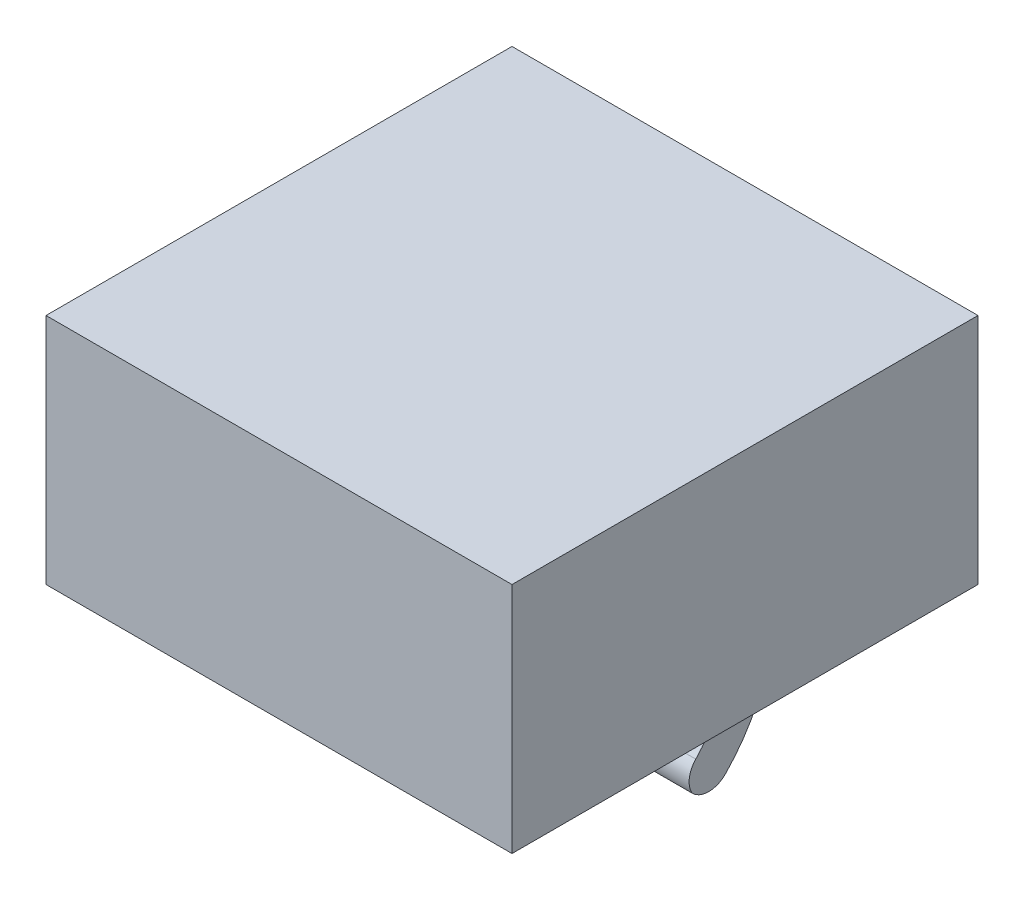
ISO-10303-21;
HEADER;
FILE_DESCRIPTION(('STEP AP214'),'2;1');
FILE_NAME('part.step','',(''),(''),'','','');
FILE_SCHEMA(('AUTOMOTIVE_DESIGN { 1 0 10303 214 1 1 1 1 }'));
ENDSEC;
DATA;
#1=APPLICATION_CONTEXT('core data for automotive mechanical design processes');
#2=APPLICATION_PROTOCOL_DEFINITION('international standard','automotive_design',2000,#1);
#3=PRODUCT_CONTEXT('',#1,'mechanical');
#4=PRODUCT('Part','Part','',(#3));
#5=PRODUCT_RELATED_PRODUCT_CATEGORY('part','',(#4));
#6=PRODUCT_DEFINITION_FORMATION('','',#4);
#7=PRODUCT_DEFINITION_CONTEXT('part definition',#1,'design');
#8=PRODUCT_DEFINITION('design','',#6,#7);
#9=PRODUCT_DEFINITION_SHAPE('','',#8);
#10=(LENGTH_UNIT() NAMED_UNIT(*) SI_UNIT(.MILLI.,.METRE.));
#11=(NAMED_UNIT(*) PLANE_ANGLE_UNIT() SI_UNIT($,.RADIAN.));
#12=(NAMED_UNIT(*) SI_UNIT($,.STERADIAN.) SOLID_ANGLE_UNIT());
#13=UNCERTAINTY_MEASURE_WITH_UNIT(LENGTH_MEASURE(1.E-05),#10,'distance_accuracy_value','');
#14=(GEOMETRIC_REPRESENTATION_CONTEXT(3) GLOBAL_UNCERTAINTY_ASSIGNED_CONTEXT((#13)) GLOBAL_UNIT_ASSIGNED_CONTEXT((#10,
#11,#12)) REPRESENTATION_CONTEXT('',''));
#15=CARTESIAN_POINT('',(0.,0.,0.));
#16=DIRECTION('',(0.,0.,1.));
#17=DIRECTION('',(1.,0.,0.));
#18=AXIS2_PLACEMENT_3D('',#15,#16,#17);
#19=CARTESIAN_POINT('',(12.7,0.,-40.8595379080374));
#20=DIRECTION('',(0.,1.,0.));
#21=DIRECTION('',(0.,0.,1.));
#22=AXIS2_PLACEMENT_3D('',#19,#20,#21);
#23=PLANE('',#22);
#24=DIRECTION('',(0.,0.,1.));
#25=VECTOR('',#24,1.);
#26=CARTESIAN_POINT('',(38.1,0.,-40.8595379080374));
#27=LINE('',#26,#25);
#28=CARTESIAN_POINT('',(38.1,0.,-40.8595379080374));
#29=VERTEX_POINT('',#28);
#30=CARTESIAN_POINT('',(38.1,0.,-35.3773366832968));
#31=VERTEX_POINT('',#30);
#32=EDGE_CURVE('E134',#29,#31,#27,.T.);
#33=ORIENTED_EDGE('',*,*,#32,.F.);
#34=DIRECTION('',(1.,0.,0.));
#35=VECTOR('',#34,1.);
#36=CARTESIAN_POINT('',(12.7,0.,-40.8595379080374));
#37=LINE('',#36,#35);
#38=CARTESIAN_POINT('',(12.7,0.,-40.8595379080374));
#39=VERTEX_POINT('',#38);
#40=EDGE_CURVE('E123',#39,#29,#37,.T.);
#41=ORIENTED_EDGE('',*,*,#40,.F.);
#42=DIRECTION('',(0.,0.,1.));
#43=VECTOR('',#42,1.);
#44=CARTESIAN_POINT('',(12.7,0.,-40.8595379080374));
#45=LINE('',#44,#43);
#46=CARTESIAN_POINT('',(12.7,0.,-35.3773366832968));
#47=VERTEX_POINT('',#46);
#48=EDGE_CURVE('E119',#39,#47,#45,.T.);
#49=ORIENTED_EDGE('',*,*,#48,.T.);
#50=DIRECTION('',(1.,0.,0.));
#51=VECTOR('',#50,1.);
#52=CARTESIAN_POINT('',(12.7,0.,-35.3773366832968));
#53=LINE('',#52,#51);
#54=EDGE_CURVE('E103',#47,#31,#53,.T.);
#55=ORIENTED_EDGE('',*,*,#54,.T.);
#56=EDGE_LOOP('',(#33,#41,#49,#55));
#57=FACE_BOUND('',#56,.T.);
#58=ADVANCED_FACE('F46',(#57),#23,.T.);
#59=CARTESIAN_POINT('',(12.7,-7.3248306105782,-40.8595379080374));
#60=DIRECTION('',(0.,0.,-1.));
#61=DIRECTION('',(-1.,0.,0.));
#62=AXIS2_PLACEMENT_3D('',#59,#60,#61);
#63=PLANE('',#62);
#64=DIRECTION('',(0.,1.,0.));
#65=VECTOR('',#64,1.);
#66=CARTESIAN_POINT('',(38.1,-7.3248306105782,-40.8595379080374));
#67=LINE('',#66,#65);
#68=CARTESIAN_POINT('',(38.1,-7.32483061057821,-40.8595379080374));
#69=VERTEX_POINT('',#68);
#70=EDGE_CURVE('E124',#69,#29,#67,.T.);
#71=ORIENTED_EDGE('',*,*,#70,.F.);
#72=DIRECTION('',(1.,0.,0.));
#73=VECTOR('',#72,1.);
#74=CARTESIAN_POINT('',(12.7,-7.32483061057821,-40.8595379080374));
#75=LINE('',#74,#73);
#76=CARTESIAN_POINT('',(12.7,-7.32483061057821,-40.8595379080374));
#77=VERTEX_POINT('',#76);
#78=EDGE_CURVE('E143',#77,#69,#75,.T.);
#79=ORIENTED_EDGE('',*,*,#78,.F.);
#80=DIRECTION('',(0.,1.,0.));
#81=VECTOR('',#80,1.);
#82=CARTESIAN_POINT('',(12.7,-7.3248306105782,-40.8595379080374));
#83=LINE('',#82,#81);
#84=EDGE_CURVE('E114',#77,#39,#83,.T.);
#85=ORIENTED_EDGE('',*,*,#84,.T.);
#86=ORIENTED_EDGE('',*,*,#40,.T.);
#87=EDGE_LOOP('',(#71,#79,#85,#86));
#88=FACE_BOUND('',#87,.T.);
#89=ADVANCED_FACE('F163',(#88),#63,.T.);
#90=CARTESIAN_POINT('',(12.7,-4.11466825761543,-22.9816122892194));
#91=DIRECTION('',(1.,0.,0.));
#92=DIRECTION('',(0.,0.,-1.));
#93=AXIS2_PLACEMENT_3D('',#90,#91,#92);
#94=CYLINDRICAL_SURFACE('',#93,18.1638477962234);
#95=CARTESIAN_POINT('',(38.1,-4.11466825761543,-22.9816122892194));
#96=DIRECTION('',(1.,0.,0.));
#97=DIRECTION('',(0.,0.,-1.));
#98=AXIS2_PLACEMENT_3D('',#95,#96,#97);
#99=CIRCLE('',#98,18.1638477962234);
#100=CARTESIAN_POINT('',(38.1,-16.8151497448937,-35.9671094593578));
#101=VERTEX_POINT('',#100);
#102=EDGE_CURVE('E127',#101,#69,#99,.T.);
#103=ORIENTED_EDGE('',*,*,#102,.F.);
#104=DIRECTION('',(1.,0.,0.));
#105=VECTOR('',#104,1.);
#106=CARTESIAN_POINT('',(12.7,-16.8151497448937,-35.9671094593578));
#107=LINE('',#106,#105);
#108=CARTESIAN_POINT('',(12.7,-16.8151497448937,-35.9671094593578));
#109=VERTEX_POINT('',#108);
#110=EDGE_CURVE('E150',#101,#109,#107,.F.);
#111=ORIENTED_EDGE('',*,*,#110,.T.);
#112=CARTESIAN_POINT('',(12.7,-4.11466825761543,-22.9816122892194));
#113=DIRECTION('',(1.,0.,0.));
#114=DIRECTION('',(0.,0.,-1.));
#115=AXIS2_PLACEMENT_3D('',#112,#113,#114);
#116=CIRCLE('',#115,18.1638477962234);
#117=EDGE_CURVE('E131',#109,#77,#116,.T.);
#118=ORIENTED_EDGE('',*,*,#117,.T.);
#119=ORIENTED_EDGE('',*,*,#78,.T.);
#120=EDGE_LOOP('',(#103,#111,#118,#119));
#121=FACE_BOUND('',#120,.T.);
#122=ADVANCED_FACE('F157',(#121),#94,.T.);
#123=CARTESIAN_POINT('',(12.7,-7.3248306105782,-26.1267297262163));
#124=DIRECTION('',(1.,0.,0.));
#125=DIRECTION('',(0.,0.,-1.));
#126=AXIS2_PLACEMENT_3D('',#123,#124,#125);
#127=CYLINDRICAL_SURFACE('',#126,9.25060695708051);
#128=CARTESIAN_POINT('',(12.7,-7.3248306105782,-26.1267297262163));
#129=DIRECTION('',(-1.,0.,0.));
#130=DIRECTION('',(0.,0.,1.));
#131=AXIS2_PLACEMENT_3D('',#128,#129,#130);
#132=CIRCLE('',#131,9.25060695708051);
#133=CARTESIAN_POINT('',(12.7,-7.3248306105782,-35.3773366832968));
#134=VERTEX_POINT('',#133);
#135=CARTESIAN_POINT('',(12.7,-13.8002286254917,-32.7330107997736));
#136=VERTEX_POINT('',#135);
#137=EDGE_CURVE('E121',#134,#136,#132,.T.);
#138=ORIENTED_EDGE('',*,*,#137,.T.);
#139=DIRECTION('',(1.,0.,0.));
#140=VECTOR('',#139,1.);
#141=CARTESIAN_POINT('',(12.7,-13.8002286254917,-32.7330107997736));
#142=LINE('',#141,#140);
#143=CARTESIAN_POINT('',(38.1,-13.8002286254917,-32.7330107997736));
#144=VERTEX_POINT('',#143);
#145=EDGE_CURVE('E12',#136,#144,#142,.T.);
#146=ORIENTED_EDGE('',*,*,#145,.T.);
#147=CARTESIAN_POINT('',(38.1,-7.3248306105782,-26.1267297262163));
#148=DIRECTION('',(-1.,0.,0.));
#149=DIRECTION('',(0.,0.,1.));
#150=AXIS2_PLACEMENT_3D('',#147,#148,#149);
#151=CIRCLE('',#150,9.25060695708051);
#152=CARTESIAN_POINT('',(38.1,-7.3248306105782,-35.3773366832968));
#153=VERTEX_POINT('',#152);
#154=EDGE_CURVE('E137',#153,#144,#151,.T.);
#155=ORIENTED_EDGE('',*,*,#154,.F.);
#156=DIRECTION('',(1.,0.,0.));
#157=VECTOR('',#156,1.);
#158=CARTESIAN_POINT('',(12.7,-7.3248306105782,-35.3773366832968));
#159=LINE('',#158,#157);
#160=EDGE_CURVE('E113',#134,#153,#159,.T.);
#161=ORIENTED_EDGE('',*,*,#160,.F.);
#162=EDGE_LOOP('',(#138,#146,#155,#161));
#163=FACE_BOUND('',#162,.T.);
#164=ADVANCED_FACE('F174',(#163),#127,.F.);
#165=CARTESIAN_POINT('',(12.7,0.,-35.3773366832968));
#166=DIRECTION('',(0.,0.,1.));
#167=DIRECTION('',(1.,0.,0.));
#168=AXIS2_PLACEMENT_3D('',#165,#166,#167);
#169=PLANE('',#168);
#170=DIRECTION('',(0.,-1.,0.));
#171=VECTOR('',#170,1.);
#172=CARTESIAN_POINT('',(38.1,0.,-35.3773366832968));
#173=LINE('',#172,#171);
#174=EDGE_CURVE('E108',#31,#153,#173,.T.);
#175=ORIENTED_EDGE('',*,*,#174,.F.);
#176=ORIENTED_EDGE('',*,*,#54,.F.);
#177=DIRECTION('',(0.,-1.,0.));
#178=VECTOR('',#177,1.);
#179=CARTESIAN_POINT('',(12.7,0.,-35.3773366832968));
#180=LINE('',#179,#178);
#181=EDGE_CURVE('E106',#47,#134,#180,.T.);
#182=ORIENTED_EDGE('',*,*,#181,.T.);
#183=ORIENTED_EDGE('',*,*,#160,.T.);
#184=EDGE_LOOP('',(#175,#176,#182,#183));
#185=FACE_BOUND('',#184,.T.);
#186=ADVANCED_FACE('F105',(#185),#169,.T.);
#187=CARTESIAN_POINT('',(12.7,-7.3248306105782,-26.1267297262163));
#188=DIRECTION('',(-1.,0.,0.));
#189=DIRECTION('',(0.,0.,1.));
#190=AXIS2_PLACEMENT_3D('',#187,#188,#189);
#191=PLANE('',#190);
#192=ORIENTED_EDGE('',*,*,#117,.F.);
#193=CARTESIAN_POINT('',(12.7,-15.0391371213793,-34.1512407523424));
#194=DIRECTION('',(-1.,0.,0.));
#195=DIRECTION('',(0.,0.,1.));
#196=AXIS2_PLACEMENT_3D('',#193,#194,#195);
#197=CIRCLE('',#196,2.54);
#198=CARTESIAN_POINT('',(12.7,-16.7985816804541,-32.3193142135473));
#199=VERTEX_POINT('',#198);
#200=EDGE_CURVE('E55',#109,#199,#197,.T.);
#201=ORIENTED_EDGE('',*,*,#200,.T.);
#202=CARTESIAN_POINT('',(12.7,-15.5782212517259,-34.5469408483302));
#203=DIRECTION('',(-1.,0.,0.));
#204=DIRECTION('',(0.,0.,1.));
#205=AXIS2_PLACEMENT_3D('',#202,#203,#204);
#206=CIRCLE('',#205,2.54);
#207=EDGE_CURVE('E65',#199,#136,#206,.T.);
#208=ORIENTED_EDGE('',*,*,#207,.T.);
#209=ORIENTED_EDGE('',*,*,#137,.F.);
#210=ORIENTED_EDGE('',*,*,#181,.F.);
#211=ORIENTED_EDGE('',*,*,#48,.F.);
#212=ORIENTED_EDGE('',*,*,#84,.F.);
#213=EDGE_LOOP('',(#192,#201,#208,#209,#210,#211,#212));
#214=FACE_BOUND('',#213,.T.);
#215=ADVANCED_FACE('F117',(#214),#191,.T.);
#216=CARTESIAN_POINT('',(38.1,-7.3248306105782,-26.1267297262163));
#217=DIRECTION('',(-1.,0.,0.));
#218=DIRECTION('',(0.,0.,1.));
#219=AXIS2_PLACEMENT_3D('',#216,#217,#218);
#220=PLANE('',#219);
#221=CARTESIAN_POINT('',(38.1,-15.5782212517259,-34.5469408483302));
#222=DIRECTION('',(-1.,0.,0.));
#223=DIRECTION('',(0.,0.,1.));
#224=AXIS2_PLACEMENT_3D('',#221,#222,#223);
#225=CIRCLE('',#224,2.54);
#226=CARTESIAN_POINT('',(38.1,-16.7985816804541,-32.3193142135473));
#227=VERTEX_POINT('',#226);
#228=EDGE_CURVE('E142',#144,#227,#225,.F.);
#229=ORIENTED_EDGE('',*,*,#228,.T.);
#230=CARTESIAN_POINT('',(38.1,-15.0391371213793,-34.1512407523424));
#231=DIRECTION('',(-1.,0.,0.));
#232=DIRECTION('',(0.,0.,1.));
#233=AXIS2_PLACEMENT_3D('',#230,#231,#232);
#234=CIRCLE('',#233,2.54);
#235=EDGE_CURVE('E148',#227,#101,#234,.F.);
#236=ORIENTED_EDGE('',*,*,#235,.T.);
#237=ORIENTED_EDGE('',*,*,#102,.T.);
#238=ORIENTED_EDGE('',*,*,#70,.T.);
#239=ORIENTED_EDGE('',*,*,#32,.T.);
#240=ORIENTED_EDGE('',*,*,#174,.T.);
#241=ORIENTED_EDGE('',*,*,#154,.T.);
#242=EDGE_LOOP('',(#229,#236,#237,#238,#239,#240,#241));
#243=FACE_BOUND('',#242,.T.);
#244=ADVANCED_FACE('F165',(#243),#220,.F.);
#245=CARTESIAN_POINT('',(12.7,-15.5782212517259,-34.5469408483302));
#246=DIRECTION('',(1.,0.,0.));
#247=DIRECTION('',(0.,0.,-1.));
#248=AXIS2_PLACEMENT_3D('',#245,#246,#247);
#249=CYLINDRICAL_SURFACE('',#248,2.54);
#250=ORIENTED_EDGE('',*,*,#145,.F.);
#251=ORIENTED_EDGE('',*,*,#207,.F.);
#252=DIRECTION('',(1.,0.,0.));
#253=VECTOR('',#252,1.);
#254=CARTESIAN_POINT('',(25.4,-16.7985816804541,-32.3193142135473));
#255=LINE('',#254,#253);
#256=EDGE_CURVE('E50',#227,#199,#255,.F.);
#257=ORIENTED_EDGE('',*,*,#256,.F.);
#258=ORIENTED_EDGE('',*,*,#228,.F.);
#259=EDGE_LOOP('',(#250,#251,#257,#258));
#260=FACE_BOUND('',#259,.T.);
#261=ADVANCED_FACE('F48',(#260),#249,.T.);
#262=CARTESIAN_POINT('',(12.7,-15.0391371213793,-34.1512407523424));
#263=DIRECTION('',(1.,0.,0.));
#264=DIRECTION('',(0.,0.,-1.));
#265=AXIS2_PLACEMENT_3D('',#262,#263,#264);
#266=CYLINDRICAL_SURFACE('',#265,2.54);
#267=ORIENTED_EDGE('',*,*,#200,.F.);
#268=ORIENTED_EDGE('',*,*,#110,.F.);
#269=ORIENTED_EDGE('',*,*,#235,.F.);
#270=ORIENTED_EDGE('',*,*,#256,.T.);
#271=EDGE_LOOP('',(#267,#268,#269,#270));
#272=FACE_BOUND('',#271,.T.);
#273=ADVANCED_FACE('F169',(#272),#266,.T.);
#274=CLOSED_SHELL('',(#58,#89,#122,#164,#186,#215,#244,#261,#273));
#275=MANIFOLD_SOLID_BREP('B2_NOT_SHOWN',#274);
#276=CARTESIAN_POINT('',(50.8,0.,0.));
#277=DIRECTION('',(0.,1.,0.));
#278=DIRECTION('',(0.,0.,1.));
#279=AXIS2_PLACEMENT_3D('',#276,#277,#278);
#280=PLANE('',#279);
#281=DIRECTION('',(1.,0.,0.));
#282=VECTOR('',#281,1.);
#283=CARTESIAN_POINT('',(12.7,0.,-40.8595379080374));
#284=LINE('',#283,#282);
#285=CARTESIAN_POINT('',(15.24,0.,-40.8595379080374));
#286=VERTEX_POINT('',#285);
#287=CARTESIAN_POINT('',(35.56,0.,-40.8595379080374));
#288=VERTEX_POINT('',#287);
#289=EDGE_CURVE('E545',#286,#288,#284,.T.);
#290=ORIENTED_EDGE('',*,*,#289,.F.);
#291=CARTESIAN_POINT('',(15.24,0.,-38.3195379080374));
#292=DIRECTION('',(0.,1.,0.));
#293=DIRECTION('',(0.,0.,1.));
#294=AXIS2_PLACEMENT_3D('',#291,#292,#293);
#295=CIRCLE('',#294,2.54);
#296=CARTESIAN_POINT('',(12.7,0.,-38.3195379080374));
#297=VERTEX_POINT('',#296);
#298=EDGE_CURVE('E265',#286,#297,#295,.T.);
#299=ORIENTED_EDGE('',*,*,#298,.T.);
#300=DIRECTION('',(0.,0.,-1.));
#301=VECTOR('',#300,1.);
#302=CARTESIAN_POINT('',(12.7,0.,-35.3773366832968));
#303=LINE('',#302,#301);
#304=CARTESIAN_POINT('',(12.7,0.,-35.3773366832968));
#305=VERTEX_POINT('',#304);
#306=EDGE_CURVE('E374',#305,#297,#303,.T.);
#307=ORIENTED_EDGE('',*,*,#306,.F.);
#308=DIRECTION('',(-1.,0.,0.));
#309=VECTOR('',#308,1.);
#310=CARTESIAN_POINT('',(12.7,0.,-35.3773366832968));
#311=LINE('',#310,#309);
#312=CARTESIAN_POINT('',(38.1,0.,-35.3773366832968));
#313=VERTEX_POINT('',#312);
#314=EDGE_CURVE('E382',#313,#305,#311,.T.);
#315=ORIENTED_EDGE('',*,*,#314,.F.);
#316=DIRECTION('',(0.,0.,1.));
#317=VECTOR('',#316,1.);
#318=CARTESIAN_POINT('',(38.1,0.,-35.3773366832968));
#319=LINE('',#318,#317);
#320=CARTESIAN_POINT('',(38.1,0.,-38.3195379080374));
#321=VERTEX_POINT('',#320);
#322=EDGE_CURVE('E390',#321,#313,#319,.T.);
#323=ORIENTED_EDGE('',*,*,#322,.F.);
#324=CARTESIAN_POINT('',(35.56,0.,-38.3195379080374));
#325=DIRECTION('',(0.,1.,0.));
#326=DIRECTION('',(0.,0.,1.));
#327=AXIS2_PLACEMENT_3D('',#324,#325,#326);
#328=CIRCLE('',#327,2.54);
#329=EDGE_CURVE('E44',#321,#288,#328,.T.);
#330=ORIENTED_EDGE('',*,*,#329,.T.);
#331=EDGE_LOOP('',(#290,#299,#307,#315,#323,#330));
#332=FACE_BOUND('',#331,.T.);
#333=DIRECTION('',(0.,0.,-1.));
#334=VECTOR('',#333,1.);
#335=CARTESIAN_POINT('',(0.,0.,0.));
#336=LINE('',#335,#334);
#337=CARTESIAN_POINT('',(0.,0.,0.));
#338=VERTEX_POINT('',#337);
#339=CARTESIAN_POINT('',(0.,0.,-50.8));
#340=VERTEX_POINT('',#339);
#341=EDGE_CURVE('E446',#338,#340,#336,.T.);
#342=ORIENTED_EDGE('',*,*,#341,.T.);
#343=DIRECTION('',(-1.,0.,0.));
#344=VECTOR('',#343,1.);
#345=CARTESIAN_POINT('',(50.8,0.,-50.8));
#346=LINE('',#345,#344);
#347=CARTESIAN_POINT('',(50.8,0.,-50.8));
#348=VERTEX_POINT('',#347);
#349=EDGE_CURVE('E456',#348,#340,#346,.T.);
#350=ORIENTED_EDGE('',*,*,#349,.F.);
#351=DIRECTION('',(0.,0.,-1.));
#352=VECTOR('',#351,1.);
#353=CARTESIAN_POINT('',(50.8,0.,0.));
#354=LINE('',#353,#352);
#355=CARTESIAN_POINT('',(50.8,0.,0.));
#356=VERTEX_POINT('',#355);
#357=EDGE_CURVE('E436',#356,#348,#354,.T.);
#358=ORIENTED_EDGE('',*,*,#357,.F.);
#359=DIRECTION('',(-1.,0.,0.));
#360=VECTOR('',#359,1.);
#361=CARTESIAN_POINT('',(50.8,0.,0.));
#362=LINE('',#361,#360);
#363=EDGE_CURVE('E459',#356,#338,#362,.T.);
#364=ORIENTED_EDGE('',*,*,#363,.T.);
#365=EDGE_LOOP('',(#342,#350,#358,#364));
#366=FACE_BOUND('',#365,.T.);
#367=DIRECTION('',(1.,0.,0.));
#368=VECTOR('',#367,1.);
#369=CARTESIAN_POINT('',(3.68715722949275,0.,-21.1582841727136));
#370=LINE('',#369,#368);
#371=CARTESIAN_POINT('',(3.68715722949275,0.,-21.1582841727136));
#372=VERTEX_POINT('',#371);
#373=CARTESIAN_POINT('',(46.3363601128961,0.,-21.1582841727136));
#374=VERTEX_POINT('',#373);
#375=EDGE_CURVE('E416',#372,#374,#370,.T.);
#376=ORIENTED_EDGE('',*,*,#375,.F.);
#377=DIRECTION('',(0.,0.,-1.));
#378=VECTOR('',#377,1.);
#379=CARTESIAN_POINT('',(3.68715722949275,0.,-4.27632009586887));
#380=LINE('',#379,#378);
#381=CARTESIAN_POINT('',(3.68715722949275,0.,-4.27632009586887));
#382=VERTEX_POINT('',#381);
#383=EDGE_CURVE('E400',#382,#372,#380,.T.);
#384=ORIENTED_EDGE('',*,*,#383,.F.);
#385=DIRECTION('',(-1.,0.,0.));
#386=VECTOR('',#385,1.);
#387=CARTESIAN_POINT('',(3.68715722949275,0.,-4.27632009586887));
#388=LINE('',#387,#386);
#389=CARTESIAN_POINT('',(46.3363601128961,0.,-4.27632009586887));
#390=VERTEX_POINT('',#389);
#391=EDGE_CURVE('E405',#390,#382,#388,.T.);
#392=ORIENTED_EDGE('',*,*,#391,.F.);
#393=DIRECTION('',(0.,0.,1.));
#394=VECTOR('',#393,1.);
#395=CARTESIAN_POINT('',(46.3363601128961,0.,-4.27632009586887));
#396=LINE('',#395,#394);
#397=EDGE_CURVE('E419',#374,#390,#396,.T.);
#398=ORIENTED_EDGE('',*,*,#397,.F.);
#399=EDGE_LOOP('',(#376,#384,#392,#398));
#400=FACE_BOUND('',#399,.T.);
#401=ADVANCED_FACE('F256',(#332,#366,#400),#280,.F.);
#402=CARTESIAN_POINT('',(50.8,0.,0.));
#403=DIRECTION('',(0.,0.,-1.));
#404=DIRECTION('',(0.,1.,0.));
#405=AXIS2_PLACEMENT_3D('',#402,#403,#404);
#406=PLANE('',#405);
#407=DIRECTION('',(0.,-1.,0.));
#408=VECTOR('',#407,1.);
#409=CARTESIAN_POINT('',(0.,0.,0.));
#410=LINE('',#409,#408);
#411=CARTESIAN_POINT('',(0.,25.4,0.));
#412=VERTEX_POINT('',#411);
#413=EDGE_CURVE('E426',#412,#338,#410,.T.);
#414=ORIENTED_EDGE('',*,*,#413,.T.);
#415=ORIENTED_EDGE('',*,*,#363,.F.);
#416=DIRECTION('',(0.,-1.,0.));
#417=VECTOR('',#416,1.);
#418=CARTESIAN_POINT('',(50.8,0.,0.));
#419=LINE('',#418,#417);
#420=CARTESIAN_POINT('',(50.8,25.4,0.));
#421=VERTEX_POINT('',#420);
#422=EDGE_CURVE('E433',#421,#356,#419,.T.);
#423=ORIENTED_EDGE('',*,*,#422,.F.);
#424=DIRECTION('',(-1.,0.,0.));
#425=VECTOR('',#424,1.);
#426=CARTESIAN_POINT('',(50.8,25.4,0.));
#427=LINE('',#426,#425);
#428=EDGE_CURVE('E443',#421,#412,#427,.T.);
#429=ORIENTED_EDGE('',*,*,#428,.T.);
#430=EDGE_LOOP('',(#414,#415,#423,#429));
#431=FACE_BOUND('',#430,.T.);
#432=ADVANCED_FACE('F520',(#431),#406,.F.);
#433=CARTESIAN_POINT('',(50.8,0.,-50.8));
#434=DIRECTION('',(0.,0.,1.));
#435=DIRECTION('',(1.,0.,0.));
#436=AXIS2_PLACEMENT_3D('',#433,#434,#435);
#437=PLANE('',#436);
#438=DIRECTION('',(0.,1.,0.));
#439=VECTOR('',#438,1.);
#440=CARTESIAN_POINT('',(0.,0.,-50.8));
#441=LINE('',#440,#439);
#442=CARTESIAN_POINT('',(0.,25.4,-50.8));
#443=VERTEX_POINT('',#442);
#444=EDGE_CURVE('E448',#340,#443,#441,.T.);
#445=ORIENTED_EDGE('',*,*,#444,.T.);
#446=DIRECTION('',(-1.,0.,0.));
#447=VECTOR('',#446,1.);
#448=CARTESIAN_POINT('',(50.8,25.4,-50.8));
#449=LINE('',#448,#447);
#450=CARTESIAN_POINT('',(50.8,25.4,-50.8));
#451=VERTEX_POINT('',#450);
#452=EDGE_CURVE('E453',#451,#443,#449,.T.);
#453=ORIENTED_EDGE('',*,*,#452,.F.);
#454=DIRECTION('',(0.,1.,0.));
#455=VECTOR('',#454,1.);
#456=CARTESIAN_POINT('',(50.8,0.,-50.8));
#457=LINE('',#456,#455);
#458=EDGE_CURVE('E439',#348,#451,#457,.T.);
#459=ORIENTED_EDGE('',*,*,#458,.F.);
#460=ORIENTED_EDGE('',*,*,#349,.T.);
#461=EDGE_LOOP('',(#445,#453,#459,#460));
#462=FACE_BOUND('',#461,.T.);
#463=ADVANCED_FACE('F525',(#462),#437,.F.);
#464=CARTESIAN_POINT('',(50.8,25.4,0.));
#465=DIRECTION('',(0.,-1.,0.));
#466=DIRECTION('',(0.,0.,-1.));
#467=AXIS2_PLACEMENT_3D('',#464,#465,#466);
#468=PLANE('',#467);
#469=DIRECTION('',(0.,0.,1.));
#470=VECTOR('',#469,1.);
#471=CARTESIAN_POINT('',(0.,25.4,0.));
#472=LINE('',#471,#470);
#473=EDGE_CURVE('E437',#443,#412,#472,.T.);
#474=ORIENTED_EDGE('',*,*,#473,.T.);
#475=ORIENTED_EDGE('',*,*,#428,.F.);
#476=DIRECTION('',(0.,0.,1.));
#477=VECTOR('',#476,1.);
#478=CARTESIAN_POINT('',(50.8,25.4,0.));
#479=LINE('',#478,#477);
#480=EDGE_CURVE('E441',#451,#421,#479,.T.);
#481=ORIENTED_EDGE('',*,*,#480,.F.);
#482=ORIENTED_EDGE('',*,*,#452,.T.);
#483=EDGE_LOOP('',(#474,#475,#481,#482));
#484=FACE_BOUND('',#483,.T.);
#485=ADVANCED_FACE('F588',(#484),#468,.F.);
#486=CARTESIAN_POINT('',(50.8,0.,0.));
#487=DIRECTION('',(-1.,0.,0.));
#488=DIRECTION('',(0.,0.,1.));
#489=AXIS2_PLACEMENT_3D('',#486,#487,#488);
#490=PLANE('',#489);
#491=ORIENTED_EDGE('',*,*,#422,.T.);
#492=ORIENTED_EDGE('',*,*,#357,.T.);
#493=ORIENTED_EDGE('',*,*,#458,.T.);
#494=ORIENTED_EDGE('',*,*,#480,.T.);
#495=EDGE_LOOP('',(#491,#492,#493,#494));
#496=FACE_BOUND('',#495,.T.);
#497=ADVANCED_FACE('F585',(#496),#490,.F.);
#498=CARTESIAN_POINT('',(0.,0.,0.));
#499=DIRECTION('',(-1.,0.,0.));
#500=DIRECTION('',(0.,0.,1.));
#501=AXIS2_PLACEMENT_3D('',#498,#499,#500);
#502=PLANE('',#501);
#503=ORIENTED_EDGE('',*,*,#413,.F.);
#504=ORIENTED_EDGE('',*,*,#473,.F.);
#505=ORIENTED_EDGE('',*,*,#444,.F.);
#506=ORIENTED_EDGE('',*,*,#341,.F.);
#507=EDGE_LOOP('',(#503,#504,#505,#506));
#508=FACE_BOUND('',#507,.T.);
#509=ADVANCED_FACE('F583',(#508),#502,.T.);
#510=CARTESIAN_POINT('',(3.68715722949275,11.176,-4.27632009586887));
#511=DIRECTION('',(-1.,0.,0.));
#512=DIRECTION('',(0.,0.,1.));
#513=AXIS2_PLACEMENT_3D('',#510,#511,#512);
#514=PLANE('',#513);
#515=ORIENTED_EDGE('',*,*,#383,.T.);
#516=DIRECTION('',(0.,-1.,0.));
#517=VECTOR('',#516,1.);
#518=CARTESIAN_POINT('',(3.68715722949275,11.176,-21.1582841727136));
#519=LINE('',#518,#517);
#520=CARTESIAN_POINT('',(3.68715722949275,11.176,-21.1582841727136));
#521=VERTEX_POINT('',#520);
#522=EDGE_CURVE('E414',#521,#372,#519,.T.);
#523=ORIENTED_EDGE('',*,*,#522,.F.);
#524=DIRECTION('',(0.,0.,-1.));
#525=VECTOR('',#524,1.);
#526=CARTESIAN_POINT('',(3.68715722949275,11.176,-4.27632009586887));
#527=LINE('',#526,#525);
#528=CARTESIAN_POINT('',(3.68715722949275,11.176,-4.27632009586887));
#529=VERTEX_POINT('',#528);
#530=EDGE_CURVE('E401',#529,#521,#527,.T.);
#531=ORIENTED_EDGE('',*,*,#530,.F.);
#532=DIRECTION('',(0.,-1.,0.));
#533=VECTOR('',#532,1.);
#534=CARTESIAN_POINT('',(3.68715722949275,11.176,-4.27632009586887));
#535=LINE('',#534,#533);
#536=EDGE_CURVE('E424',#529,#382,#535,.T.);
#537=ORIENTED_EDGE('',*,*,#536,.T.);
#538=EDGE_LOOP('',(#515,#523,#531,#537));
#539=FACE_BOUND('',#538,.T.);
#540=ADVANCED_FACE('F573',(#539),#514,.F.);
#541=CARTESIAN_POINT('',(3.68715722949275,11.176,-4.27632009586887));
#542=DIRECTION('',(0.,0.,1.));
#543=DIRECTION('',(1.,0.,0.));
#544=AXIS2_PLACEMENT_3D('',#541,#542,#543);
#545=PLANE('',#544);
#546=ORIENTED_EDGE('',*,*,#391,.T.);
#547=ORIENTED_EDGE('',*,*,#536,.F.);
#548=DIRECTION('',(-1.,0.,0.));
#549=VECTOR('',#548,1.);
#550=CARTESIAN_POINT('',(3.68715722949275,11.176,-4.27632009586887));
#551=LINE('',#550,#549);
#552=CARTESIAN_POINT('',(46.3363601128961,11.176,-4.27632009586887));
#553=VERTEX_POINT('',#552);
#554=EDGE_CURVE('E411',#553,#529,#551,.T.);
#555=ORIENTED_EDGE('',*,*,#554,.F.);
#556=DIRECTION('',(0.,-1.,0.));
#557=VECTOR('',#556,1.);
#558=CARTESIAN_POINT('',(46.3363601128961,11.176,-4.27632009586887));
#559=LINE('',#558,#557);
#560=EDGE_CURVE('E427',#553,#390,#559,.T.);
#561=ORIENTED_EDGE('',*,*,#560,.T.);
#562=EDGE_LOOP('',(#546,#547,#555,#561));
#563=FACE_BOUND('',#562,.T.);
#564=ADVANCED_FACE('F569',(#563),#545,.F.);
#565=CARTESIAN_POINT('',(46.3363601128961,11.176,-4.27632009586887));
#566=DIRECTION('',(1.,0.,0.));
#567=DIRECTION('',(0.,0.,-1.));
#568=AXIS2_PLACEMENT_3D('',#565,#566,#567);
#569=PLANE('',#568);
#570=ORIENTED_EDGE('',*,*,#397,.T.);
#571=ORIENTED_EDGE('',*,*,#560,.F.);
#572=DIRECTION('',(0.,0.,1.));
#573=VECTOR('',#572,1.);
#574=CARTESIAN_POINT('',(46.3363601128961,11.176,-4.27632009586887));
#575=LINE('',#574,#573);
#576=CARTESIAN_POINT('',(46.3363601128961,11.176,-21.1582841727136));
#577=VERTEX_POINT('',#576);
#578=EDGE_CURVE('E408',#577,#553,#575,.T.);
#579=ORIENTED_EDGE('',*,*,#578,.F.);
#580=DIRECTION('',(0.,-1.,0.));
#581=VECTOR('',#580,1.);
#582=CARTESIAN_POINT('',(46.3363601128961,11.176,-21.1582841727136));
#583=LINE('',#582,#581);
#584=EDGE_CURVE('E429',#577,#374,#583,.T.);
#585=ORIENTED_EDGE('',*,*,#584,.T.);
#586=EDGE_LOOP('',(#570,#571,#579,#585));
#587=FACE_BOUND('',#586,.T.);
#588=ADVANCED_FACE('F572',(#587),#569,.F.);
#589=CARTESIAN_POINT('',(3.68715722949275,11.176,-21.1582841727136));
#590=DIRECTION('',(0.,0.,-1.));
#591=DIRECTION('',(-1.,0.,0.));
#592=AXIS2_PLACEMENT_3D('',#589,#590,#591);
#593=PLANE('',#592);
#594=ORIENTED_EDGE('',*,*,#375,.T.);
#595=ORIENTED_EDGE('',*,*,#584,.F.);
#596=DIRECTION('',(1.,0.,0.));
#597=VECTOR('',#596,1.);
#598=CARTESIAN_POINT('',(3.68715722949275,11.176,-21.1582841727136));
#599=LINE('',#598,#597);
#600=EDGE_CURVE('E404',#521,#577,#599,.T.);
#601=ORIENTED_EDGE('',*,*,#600,.F.);
#602=ORIENTED_EDGE('',*,*,#522,.T.);
#603=EDGE_LOOP('',(#594,#595,#601,#602));
#604=FACE_BOUND('',#603,.T.);
#605=ADVANCED_FACE('F567',(#604),#593,.F.);
#606=CARTESIAN_POINT('',(0.,11.176,0.));
#607=DIRECTION('',(0.,-1.,0.));
#608=DIRECTION('',(0.,0.,-1.));
#609=AXIS2_PLACEMENT_3D('',#606,#607,#608);
#610=PLANE('',#609);
#611=ORIENTED_EDGE('',*,*,#530,.T.);
#612=ORIENTED_EDGE('',*,*,#600,.T.);
#613=ORIENTED_EDGE('',*,*,#578,.T.);
#614=ORIENTED_EDGE('',*,*,#554,.T.);
#615=EDGE_LOOP('',(#611,#612,#613,#614));
#616=FACE_BOUND('',#615,.T.);
#617=ADVANCED_FACE('F561',(#616),#610,.T.);
#618=CARTESIAN_POINT('',(12.7,-23.876,-35.3773366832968));
#619=DIRECTION('',(1.,0.,0.));
#620=DIRECTION('',(0.,0.,-1.));
#621=AXIS2_PLACEMENT_3D('',#618,#619,#620);
#622=PLANE('',#621);
#623=ORIENTED_EDGE('',*,*,#306,.T.);
#624=DIRECTION('',(0.,-1.,0.));
#625=VECTOR('',#624,1.);
#626=CARTESIAN_POINT('',(12.7,-23.876,-38.3195379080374));
#627=LINE('',#626,#625);
#628=CARTESIAN_POINT('',(12.7,-7.32483061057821,-38.3195379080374));
#629=VERTEX_POINT('',#628);
#630=EDGE_CURVE('E465',#297,#629,#627,.T.);
#631=ORIENTED_EDGE('',*,*,#630,.T.);
#632=CARTESIAN_POINT('',(12.7,-7.32483061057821,-28.8761962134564));
#633=DIRECTION('',(1.,0.,0.));
#634=DIRECTION('',(0.,0.,-1.));
#635=AXIS2_PLACEMENT_3D('',#632,#633,#634);
#636=CIRCLE('',#635,9.44334169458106);
#637=CARTESIAN_POINT('',(12.7,-12.3625515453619,-36.8635656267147));
#638=VERTEX_POINT('',#637);
#639=EDGE_CURVE('E463',#629,#638,#636,.F.);
#640=ORIENTED_EDGE('',*,*,#639,.T.);
#641=CARTESIAN_POINT('',(12.7,-10.0514551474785,-37.9173366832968));
#642=DIRECTION('',(1.,0.,0.));
#643=DIRECTION('',(0.,0.,-1.));
#644=AXIS2_PLACEMENT_3D('',#641,#642,#643);
#645=CIRCLE('',#644,2.54);
#646=CARTESIAN_POINT('',(12.7,-10.0514551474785,-35.3773366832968));
#647=VERTEX_POINT('',#646);
#648=EDGE_CURVE('E377',#638,#647,#645,.F.);
#649=ORIENTED_EDGE('',*,*,#648,.T.);
#650=DIRECTION('',(0.,1.,0.));
#651=VECTOR('',#650,1.);
#652=CARTESIAN_POINT('',(12.7,-23.876,-35.3773366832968));
#653=LINE('',#652,#651);
#654=EDGE_CURVE('E370',#647,#305,#653,.T.);
#655=ORIENTED_EDGE('',*,*,#654,.T.);
#656=EDGE_LOOP('',(#623,#631,#640,#649,#655));
#657=FACE_BOUND('',#656,.T.);
#658=ADVANCED_FACE('F372',(#657),#622,.F.);
#659=CARTESIAN_POINT('',(38.1,-23.876,-35.3773366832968));
#660=DIRECTION('',(-1.,0.,0.));
#661=DIRECTION('',(0.,0.,1.));
#662=AXIS2_PLACEMENT_3D('',#659,#660,#661);
#663=PLANE('',#662);
#664=CARTESIAN_POINT('',(38.1,-7.32483061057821,-28.8761962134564));
#665=DIRECTION('',(-1.,0.,0.));
#666=DIRECTION('',(0.,0.,1.));
#667=AXIS2_PLACEMENT_3D('',#664,#665,#666);
#668=CIRCLE('',#667,9.44334169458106);
#669=CARTESIAN_POINT('',(38.1,-12.3625515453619,-36.8635656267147));
#670=VERTEX_POINT('',#669);
#671=CARTESIAN_POINT('',(38.1,-7.32483061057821,-38.3195379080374));
#672=VERTEX_POINT('',#671);
#673=EDGE_CURVE('E471',#670,#672,#668,.F.);
#674=ORIENTED_EDGE('',*,*,#673,.T.);
#675=DIRECTION('',(0.,-1.,0.));
#676=VECTOR('',#675,1.);
#677=CARTESIAN_POINT('',(38.1,-23.876,-38.3195379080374));
#678=LINE('',#677,#676);
#679=EDGE_CURVE('E475',#672,#321,#678,.F.);
#680=ORIENTED_EDGE('',*,*,#679,.T.);
#681=ORIENTED_EDGE('',*,*,#322,.T.);
#682=DIRECTION('',(0.,1.,0.));
#683=VECTOR('',#682,1.);
#684=CARTESIAN_POINT('',(38.1,-23.876,-35.3773366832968));
#685=LINE('',#684,#683);
#686=CARTESIAN_POINT('',(38.1,-10.0514551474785,-35.3773366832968));
#687=VERTEX_POINT('',#686);
#688=EDGE_CURVE('E381',#687,#313,#685,.T.);
#689=ORIENTED_EDGE('',*,*,#688,.F.);
#690=CARTESIAN_POINT('',(38.1,-10.0514551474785,-37.9173366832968));
#691=DIRECTION('',(-1.,0.,0.));
#692=DIRECTION('',(0.,0.,1.));
#693=AXIS2_PLACEMENT_3D('',#690,#691,#692);
#694=CIRCLE('',#693,2.54);
#695=EDGE_CURVE('E473',#687,#670,#694,.F.);
#696=ORIENTED_EDGE('',*,*,#695,.T.);
#697=EDGE_LOOP('',(#674,#680,#681,#689,#696));
#698=FACE_BOUND('',#697,.T.);
#699=ADVANCED_FACE('F552',(#698),#663,.F.);
#700=CARTESIAN_POINT('',(12.7,-23.876,-35.3773366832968));
#701=DIRECTION('',(0.,0.,-1.));
#702=DIRECTION('',(-1.,0.,0.));
#703=AXIS2_PLACEMENT_3D('',#700,#701,#702);
#704=PLANE('',#703);
#705=ORIENTED_EDGE('',*,*,#654,.F.);
#706=DIRECTION('',(1.,0.,0.));
#707=VECTOR('',#706,1.);
#708=CARTESIAN_POINT('',(12.7,-10.0514551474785,-35.3773366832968));
#709=LINE('',#708,#707);
#710=EDGE_CURVE('E481',#647,#687,#709,.T.);
#711=ORIENTED_EDGE('',*,*,#710,.T.);
#712=ORIENTED_EDGE('',*,*,#688,.T.);
#713=ORIENTED_EDGE('',*,*,#314,.T.);
#714=EDGE_LOOP('',(#705,#711,#712,#713));
#715=FACE_BOUND('',#714,.T.);
#716=ADVANCED_FACE('F394',(#715),#704,.F.);
#717=CARTESIAN_POINT('',(12.7,-7.32483061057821,-28.8761962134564));
#718=DIRECTION('',(1.,0.,0.));
#719=DIRECTION('',(0.,0.,-1.));
#720=AXIS2_PLACEMENT_3D('',#717,#718,#719);
#721=CYLINDRICAL_SURFACE('',#720,11.9833416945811);
#722=DIRECTION('',(1.,0.,0.));
#723=VECTOR('',#722,1.);
#724=CARTESIAN_POINT('',(12.7,-10.7848423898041,-40.3491555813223));
#725=LINE('',#724,#723);
#726=CARTESIAN_POINT('',(35.56,-10.7848423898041,-40.3491555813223));
#727=VERTEX_POINT('',#726);
#728=CARTESIAN_POINT('',(15.24,-10.7848423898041,-40.3491555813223));
#729=VERTEX_POINT('',#728);
#730=EDGE_CURVE('E273',#727,#729,#725,.F.);
#731=ORIENTED_EDGE('',*,*,#730,.T.);
#732=CARTESIAN_POINT('',(15.24,-7.32483061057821,-28.8761962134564));
#733=DIRECTION('',(1.,0.,0.));
#734=DIRECTION('',(0.,0.,-1.));
#735=AXIS2_PLACEMENT_3D('',#732,#733,#734);
#736=CIRCLE('',#735,11.9833416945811);
#737=CARTESIAN_POINT('',(15.24,-7.32483061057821,-40.8595379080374));
#738=VERTEX_POINT('',#737);
#739=EDGE_CURVE('E479',#729,#738,#736,.T.);
#740=ORIENTED_EDGE('',*,*,#739,.T.);
#741=DIRECTION('',(1.,0.,0.));
#742=VECTOR('',#741,1.);
#743=CARTESIAN_POINT('',(12.7,-7.32483061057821,-40.8595379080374));
#744=LINE('',#743,#742);
#745=CARTESIAN_POINT('',(35.56,-7.32483061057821,-40.8595379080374));
#746=VERTEX_POINT('',#745);
#747=EDGE_CURVE('E391',#738,#746,#744,.T.);
#748=ORIENTED_EDGE('',*,*,#747,.T.);
#749=CARTESIAN_POINT('',(35.56,-7.32483061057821,-28.8761962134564));
#750=DIRECTION('',(-1.,0.,0.));
#751=DIRECTION('',(0.,0.,1.));
#752=AXIS2_PLACEMENT_3D('',#749,#750,#751);
#753=CIRCLE('',#752,11.9833416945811);
#754=EDGE_CURVE('E278',#746,#727,#753,.T.);
#755=ORIENTED_EDGE('',*,*,#754,.T.);
#756=EDGE_LOOP('',(#731,#740,#748,#755));
#757=FACE_BOUND('',#756,.T.);
#758=ADVANCED_FACE('F540',(#757),#721,.T.);
#759=CARTESIAN_POINT('',(12.7,0.,-40.8595379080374));
#760=DIRECTION('',(0.,0.,1.));
#761=DIRECTION('',(1.,0.,0.));
#762=AXIS2_PLACEMENT_3D('',#759,#760,#761);
#763=PLANE('',#762);
#764=ORIENTED_EDGE('',*,*,#747,.F.);
#765=DIRECTION('',(0.,-1.,0.));
#766=VECTOR('',#765,1.);
#767=CARTESIAN_POINT('',(15.24,0.,-40.8595379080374));
#768=LINE('',#767,#766);
#769=EDGE_CURVE('E469',#738,#286,#768,.F.);
#770=ORIENTED_EDGE('',*,*,#769,.T.);
#771=ORIENTED_EDGE('',*,*,#289,.T.);
#772=DIRECTION('',(0.,-1.,0.));
#773=VECTOR('',#772,1.);
#774=CARTESIAN_POINT('',(35.56,0.,-40.8595379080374));
#775=LINE('',#774,#773);
#776=EDGE_CURVE('E467',#288,#746,#775,.T.);
#777=ORIENTED_EDGE('',*,*,#776,.T.);
#778=EDGE_LOOP('',(#764,#770,#771,#777));
#779=FACE_BOUND('',#778,.T.);
#780=ADVANCED_FACE('F516',(#779),#763,.F.);
#781=CARTESIAN_POINT('',(35.56,0.,-38.3195379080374));
#782=DIRECTION('',(0.,-1.,0.));
#783=DIRECTION('',(0.,0.,-1.));
#784=AXIS2_PLACEMENT_3D('',#781,#782,#783);
#785=CYLINDRICAL_SURFACE('',#784,2.54);
#786=ORIENTED_EDGE('',*,*,#329,.F.);
#787=ORIENTED_EDGE('',*,*,#679,.F.);
#788=CARTESIAN_POINT('',(35.56,-7.32483061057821,-38.3195379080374));
#789=DIRECTION('',(0.,-1.,0.));
#790=DIRECTION('',(0.,0.,-1.));
#791=AXIS2_PLACEMENT_3D('',#788,#789,#790);
#792=CIRCLE('',#791,2.54);
#793=EDGE_CURVE('E260',#746,#672,#792,.T.);
#794=ORIENTED_EDGE('',*,*,#793,.F.);
#795=ORIENTED_EDGE('',*,*,#776,.F.);
#796=EDGE_LOOP('',(#786,#787,#794,#795));
#797=FACE_BOUND('',#796,.T.);
#798=ADVANCED_FACE('F258',(#797),#785,.T.);
#799=CARTESIAN_POINT('',(35.56,-7.32483061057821,-28.8761962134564));
#800=DIRECTION('',(-1.,0.,0.));
#801=DIRECTION('',(0.,0.,1.));
#802=AXIS2_PLACEMENT_3D('',#799,#800,#801);
#803=TOROIDAL_SURFACE('',#802,9.44334169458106,2.54);
#804=ORIENTED_EDGE('',*,*,#793,.T.);
#805=ORIENTED_EDGE('',*,*,#673,.F.);
#806=CARTESIAN_POINT('',(38.1,-12.3625515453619,-36.8635656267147));
#807=CARTESIAN_POINT('',(38.1000118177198,-12.3869216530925,-36.9169785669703));
#808=CARTESIAN_POINT('',(38.0980015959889,-12.4094062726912,-36.9712310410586));
#809=CARTESIAN_POINT('',(38.0901432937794,-12.4504789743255,-37.0808629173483));
#810=CARTESIAN_POINT('',(38.0842989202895,-12.4690707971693,-37.1362411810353));
#811=CARTESIAN_POINT('',(38.0690416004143,-12.5021414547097,-37.2472133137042));
#812=CARTESIAN_POINT('',(38.0596587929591,-12.5166532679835,-37.3028015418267));
#813=CARTESIAN_POINT('',(38.0375838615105,-12.541778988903,-37.4141947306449));
#814=CARTESIAN_POINT('',(38.0248910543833,-12.5523920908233,-37.4699997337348));
#815=CARTESIAN_POINT('',(37.9823648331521,-12.5783948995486,-37.6366953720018));
#816=CARTESIAN_POINT('',(37.9480088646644,-12.5880984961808,-37.7473817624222));
#817=CARTESIAN_POINT('',(37.8694230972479,-12.5933549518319,-37.9656375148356));
#818=CARTESIAN_POINT('',(37.8251698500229,-12.5888738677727,-38.0731987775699));
#819=CARTESIAN_POINT('',(37.7101953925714,-12.5629615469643,-38.323970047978));
#820=CARTESIAN_POINT('',(37.6358496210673,-12.5356578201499,-38.464923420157));
#821=CARTESIAN_POINT('',(37.4763240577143,-12.4604701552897,-38.7346019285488));
#822=CARTESIAN_POINT('',(37.3911287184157,-12.4125564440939,-38.8633090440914));
#823=CARTESIAN_POINT('',(37.1874314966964,-12.2834131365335,-39.1420043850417));
#824=CARTESIAN_POINT('',(37.0663801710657,-12.1965714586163,-39.2875255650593));
#825=CARTESIAN_POINT('',(36.8159860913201,-12.0006160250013,-39.5543548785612));
#826=CARTESIAN_POINT('',(36.686634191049,-11.8914774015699,-39.6756356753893));
#827=CARTESIAN_POINT('',(36.4207246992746,-11.6539593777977,-39.8947327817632));
#828=CARTESIAN_POINT('',(36.2840849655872,-11.525300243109,-39.9921429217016));
#829=CARTESIAN_POINT('',(36.00820312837,-11.2545105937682,-40.1600069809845));
#830=CARTESIAN_POINT('',(35.8689664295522,-11.1124059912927,-40.2305114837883));
#831=CARTESIAN_POINT('',(35.6755113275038,-10.9086683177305,-40.3090922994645));
#832=CARTESIAN_POINT('',(35.6215255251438,-10.8511353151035,-40.3289358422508));
#833=CARTESIAN_POINT('',(35.5650253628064,-10.7902609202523,-40.347516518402));
#834=CARTESIAN_POINT('',(35.5625126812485,-10.7875523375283,-40.348338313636));
#835=CARTESIAN_POINT('',(35.56,-10.784842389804,-40.3491555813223));
#836=B_SPLINE_CURVE_WITH_KNOTS('',3,(#806,#807,#808,#809,#810,#811,#812,#813,#814,#815,#816,
#817,#818,#819,#820,#821,#822,#823,#824,#825,#826,#827,#828,#829,#830,#831,#832,#833,#834,#835),
.UNSPECIFIED.,.F.,.F.,(4,2,2,2,2,2,2,2,2,2,2,2,2,2,4),(0.,0.176030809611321,0.351891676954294,
0.526287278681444,0.700718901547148,1.0479779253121,1.39606854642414,1.87845492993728,
2.36154052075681,2.98302565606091,3.60520775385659,4.23733770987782,4.86827331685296,
5.11223947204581,5.12359411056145),.UNSPECIFIED.);
#837=EDGE_CURVE('E494',#727,#670,#836,.F.);
#838=ORIENTED_EDGE('',*,*,#837,.F.);
#839=ORIENTED_EDGE('',*,*,#754,.F.);
#840=EDGE_LOOP('',(#804,#805,#838,#839));
#841=FACE_BOUND('',#840,.T.);
#842=ADVANCED_FACE('F507',(#841),#803,.T.);
#843=CARTESIAN_POINT('',(12.7,-10.0514551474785,-37.9173366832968));
#844=DIRECTION('',(1.,0.,0.));
#845=DIRECTION('',(0.,0.,-1.));
#846=AXIS2_PLACEMENT_3D('',#843,#844,#845);
#847=CYLINDRICAL_SURFACE('',#846,2.54);
#848=ORIENTED_EDGE('',*,*,#710,.F.);
#849=ORIENTED_EDGE('',*,*,#648,.F.);
#850=CARTESIAN_POINT('',(12.7,-12.3625515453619,-36.8635656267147));
#851=CARTESIAN_POINT('',(12.6999881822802,-12.3869216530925,-36.9169785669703));
#852=CARTESIAN_POINT('',(12.7019984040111,-12.4094062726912,-36.9712310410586));
#853=CARTESIAN_POINT('',(12.7098567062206,-12.4504789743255,-37.0808629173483));
#854=CARTESIAN_POINT('',(12.7157010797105,-12.4690707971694,-37.1362411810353));
#855=CARTESIAN_POINT('',(12.7309583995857,-12.5021414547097,-37.2472133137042));
#856=CARTESIAN_POINT('',(12.7403412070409,-12.5166532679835,-37.3028015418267));
#857=CARTESIAN_POINT('',(12.7624161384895,-12.541778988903,-37.4141947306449));
#858=CARTESIAN_POINT('',(12.7751089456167,-12.5523920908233,-37.4699997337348));
#859=CARTESIAN_POINT('',(12.8176351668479,-12.5783948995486,-37.6366953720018));
#860=CARTESIAN_POINT('',(12.8519911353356,-12.5880984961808,-37.7473817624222));
#861=CARTESIAN_POINT('',(12.9305769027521,-12.5933549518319,-37.9656375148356));
#862=CARTESIAN_POINT('',(12.9748301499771,-12.5888738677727,-38.0731987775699));
#863=CARTESIAN_POINT('',(13.0898046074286,-12.5629615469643,-38.323970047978));
#864=CARTESIAN_POINT('',(13.1641503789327,-12.5356578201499,-38.4649234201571));
#865=CARTESIAN_POINT('',(13.3236759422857,-12.4604701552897,-38.7346019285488));
#866=CARTESIAN_POINT('',(13.4088712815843,-12.4125564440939,-38.8633090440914));
#867=CARTESIAN_POINT('',(13.6125685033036,-12.2834131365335,-39.1420043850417));
#868=CARTESIAN_POINT('',(13.7336198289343,-12.1965714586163,-39.2875255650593));
#869=CARTESIAN_POINT('',(13.9840139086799,-12.0006160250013,-39.5543548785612));
#870=CARTESIAN_POINT('',(14.1133658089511,-11.8914774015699,-39.6756356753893));
#871=CARTESIAN_POINT('',(14.3792753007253,-11.6539593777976,-39.8947327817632));
#872=CARTESIAN_POINT('',(14.5159150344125,-11.5253002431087,-39.9921429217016));
#873=CARTESIAN_POINT('',(14.7917968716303,-11.2545105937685,-40.1600069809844));
#874=CARTESIAN_POINT('',(14.9310335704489,-11.1124059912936,-40.230511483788));
#875=CARTESIAN_POINT('',(15.1244886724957,-10.9086683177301,-40.3090922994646));
#876=CARTESIAN_POINT('',(15.178474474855,-10.8511353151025,-40.3289358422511));
#877=CARTESIAN_POINT('',(15.2349746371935,-10.7902609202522,-40.347516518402));
#878=CARTESIAN_POINT('',(15.2374873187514,-10.7875523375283,-40.348338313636));
#879=CARTESIAN_POINT('',(15.24,-10.784842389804,-40.3491555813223));
#880=B_SPLINE_CURVE_WITH_KNOTS('',3,(#850,#851,#852,#853,#854,#855,#856,#857,#858,#859,#860,
#861,#862,#863,#864,#865,#866,#867,#868,#869,#870,#871,#872,#873,#874,#875,#876,#877,#878,#879),
.UNSPECIFIED.,.F.,.F.,(4,2,2,2,2,2,2,2,2,2,2,2,2,2,4),(0.,0.176030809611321,0.351891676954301,
0.526287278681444,0.700718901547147,1.04797792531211,1.39606854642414,1.87845492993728,
2.3615405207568,2.98302565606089,3.60520775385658,4.23733770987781,4.86827331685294,
5.11223947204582,5.12359411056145),.UNSPECIFIED.);
#881=EDGE_CURVE('E486',#729,#638,#880,.F.);
#882=ORIENTED_EDGE('',*,*,#881,.F.);
#883=ORIENTED_EDGE('',*,*,#730,.F.);
#884=ORIENTED_EDGE('',*,*,#837,.T.);
#885=ORIENTED_EDGE('',*,*,#695,.F.);
#886=EDGE_LOOP('',(#848,#849,#882,#883,#884,#885));
#887=FACE_BOUND('',#886,.T.);
#888=ADVANCED_FACE('F499',(#887),#847,.T.);
#889=CARTESIAN_POINT('',(15.24,-7.32483061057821,-28.8761962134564));
#890=DIRECTION('',(1.,0.,0.));
#891=DIRECTION('',(0.,0.,-1.));
#892=AXIS2_PLACEMENT_3D('',#889,#890,#891);
#893=TOROIDAL_SURFACE('',#892,9.44334169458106,2.54);
#894=ORIENTED_EDGE('',*,*,#881,.T.);
#895=ORIENTED_EDGE('',*,*,#639,.F.);
#896=CARTESIAN_POINT('',(15.24,-7.32483061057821,-38.3195379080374));
#897=DIRECTION('',(0.,1.,0.));
#898=DIRECTION('',(0.,0.,1.));
#899=AXIS2_PLACEMENT_3D('',#896,#897,#898);
#900=CIRCLE('',#899,2.54);
#901=EDGE_CURVE('E484',#738,#629,#900,.T.);
#902=ORIENTED_EDGE('',*,*,#901,.F.);
#903=ORIENTED_EDGE('',*,*,#739,.F.);
#904=EDGE_LOOP('',(#894,#895,#902,#903));
#905=FACE_BOUND('',#904,.T.);
#906=ADVANCED_FACE('F502',(#905),#893,.T.);
#907=CARTESIAN_POINT('',(15.24,-23.876,-38.3195379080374));
#908=DIRECTION('',(0.,-1.,0.));
#909=DIRECTION('',(0.,0.,-1.));
#910=AXIS2_PLACEMENT_3D('',#907,#908,#909);
#911=CYLINDRICAL_SURFACE('',#910,2.54);
#912=ORIENTED_EDGE('',*,*,#298,.F.);
#913=ORIENTED_EDGE('',*,*,#769,.F.);
#914=ORIENTED_EDGE('',*,*,#901,.T.);
#915=ORIENTED_EDGE('',*,*,#630,.F.);
#916=EDGE_LOOP('',(#912,#913,#914,#915));
#917=FACE_BOUND('',#916,.T.);
#918=ADVANCED_FACE('F505',(#917),#911,.T.);
#919=CLOSED_SHELL('',(#401,#432,#463,#485,#497,#509,#540,#564,#588,#605,#617,#658,#699,#716,
#758,#780,#798,#842,#888,#906,#918));
#920=MANIFOLD_SOLID_BREP('B6',#919);
#921=ADVANCED_BREP_SHAPE_REPRESENTATION('',(#18,#275,#920),#14);
#922=SHAPE_DEFINITION_REPRESENTATION(#9,#921);
ENDSEC;
END-ISO-10303-21;
